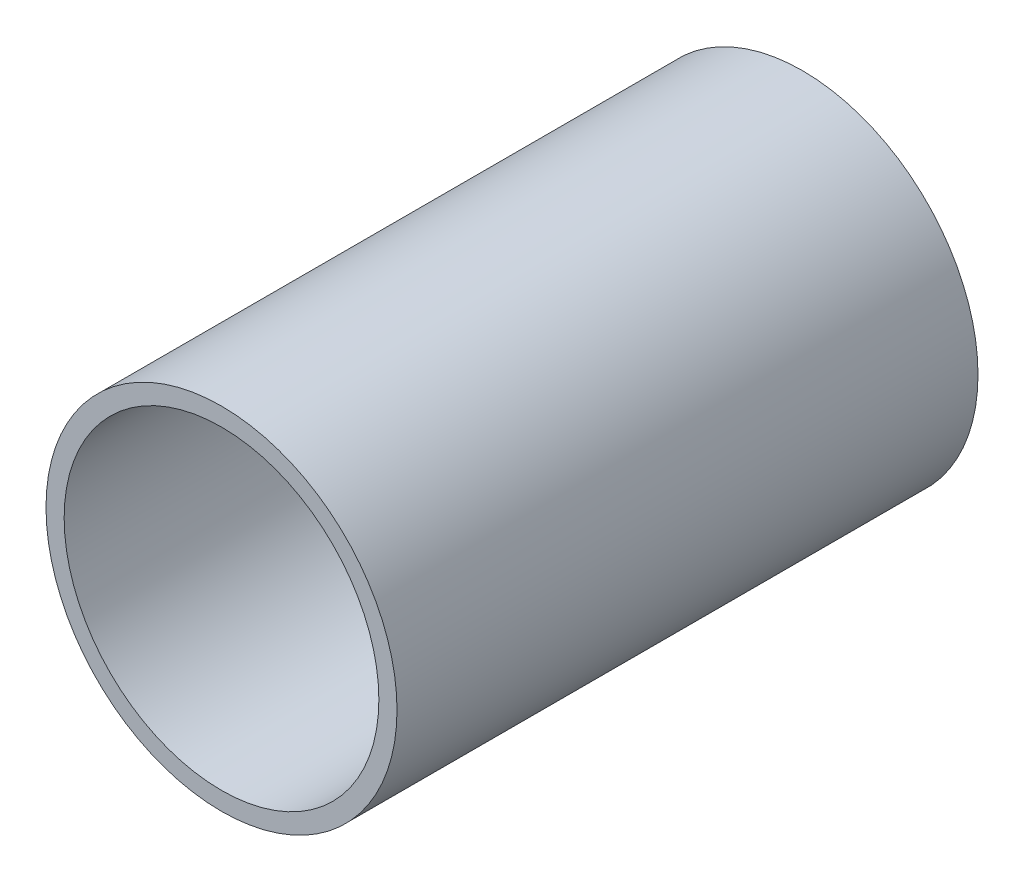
from build123d import *

# Parameters (mm, degrees)
ESQUISSE1_R            = 14.5
ESQUISSE1_R_2          = 13
BASE_EXTRU_MINCE_DEPTH = 48


with BuildPart() as part:
    # Esquisse1 → Base-Extru.-Mince (new body)
    with BuildSketch(Plane.XY):
        Circle(ESQUISSE1_R)
        Circle(ESQUISSE1_R_2, mode=Mode.SUBTRACT)
    extrude(amount=BASE_EXTRU_MINCE_DEPTH)


solid = part.part
